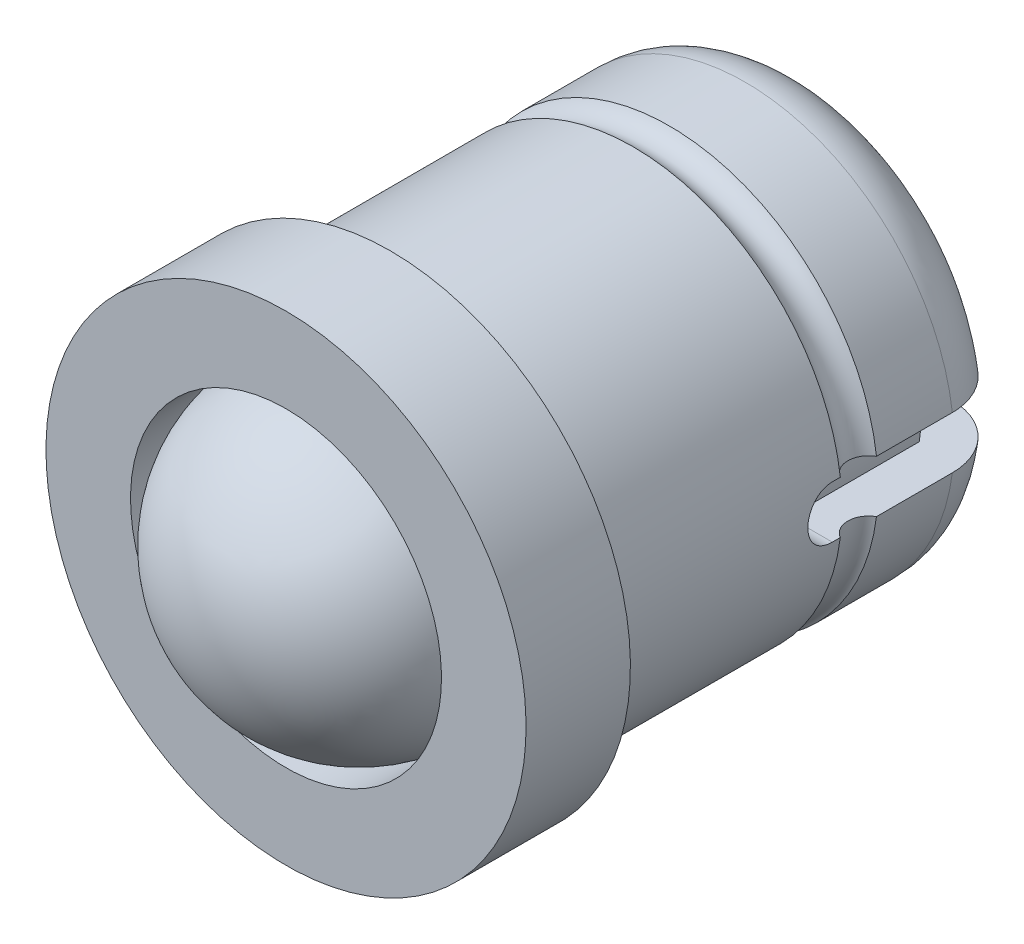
ISO-10303-21;
HEADER;
FILE_DESCRIPTION(('STEP AP214'),'2;1');
FILE_NAME('part.step','',(''),(''),'','','');
FILE_SCHEMA(('AUTOMOTIVE_DESIGN { 1 0 10303 214 1 1 1 1 }'));
ENDSEC;
DATA;
#1=APPLICATION_CONTEXT('core data for automotive mechanical design processes');
#2=APPLICATION_PROTOCOL_DEFINITION('international standard','automotive_design',2000,#1);
#3=PRODUCT_CONTEXT('',#1,'mechanical');
#4=PRODUCT('Part','Part','',(#3));
#5=PRODUCT_RELATED_PRODUCT_CATEGORY('part','',(#4));
#6=PRODUCT_DEFINITION_FORMATION('','',#4);
#7=PRODUCT_DEFINITION_CONTEXT('part definition',#1,'design');
#8=PRODUCT_DEFINITION('design','',#6,#7);
#9=PRODUCT_DEFINITION_SHAPE('','',#8);
#10=(LENGTH_UNIT() NAMED_UNIT(*) SI_UNIT(.MILLI.,.METRE.));
#11=(NAMED_UNIT(*) PLANE_ANGLE_UNIT() SI_UNIT($,.RADIAN.));
#12=(NAMED_UNIT(*) SI_UNIT($,.STERADIAN.) SOLID_ANGLE_UNIT());
#13=UNCERTAINTY_MEASURE_WITH_UNIT(LENGTH_MEASURE(1.E-05),#10,'distance_accuracy_value','');
#14=(GEOMETRIC_REPRESENTATION_CONTEXT(3) GLOBAL_UNCERTAINTY_ASSIGNED_CONTEXT((#13)) GLOBAL_UNIT_ASSIGNED_CONTEXT((#10,
#11,#12)) REPRESENTATION_CONTEXT('',''));
#15=CARTESIAN_POINT('',(0.,0.,0.));
#16=DIRECTION('',(0.,0.,1.));
#17=DIRECTION('',(1.,0.,0.));
#18=AXIS2_PLACEMENT_3D('',#15,#16,#17);
#19=CARTESIAN_POINT('',(2.3,-0.25,-2.25));
#20=DIRECTION('',(0.,1.,0.));
#21=DIRECTION('',(0.,0.,1.));
#22=AXIS2_PLACEMENT_3D('',#19,#20,#21);
#23=PLANE('',#22);
#24=DIRECTION('',(1.,0.,0.));
#25=VECTOR('',#24,1.);
#26=CARTESIAN_POINT('',(2.3,-0.25,-3.5));
#27=LINE('',#26,#25);
#28=CARTESIAN_POINT('',(-1.56793880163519,-0.25,-3.5));
#29=VERTEX_POINT('',#28);
#30=CARTESIAN_POINT('',(1.56793880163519,-0.25,-3.5));
#31=VERTEX_POINT('',#30);
#32=EDGE_CURVE('E322',#29,#31,#27,.T.);
#33=ORIENTED_EDGE('',*,*,#32,.T.);
#34=DIRECTION('',(0.,0.,-1.));
#35=VECTOR('',#34,1.);
#36=CARTESIAN_POINT('',(1.56793880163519,-0.25,-5.01992469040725));
#37=LINE('',#36,#35);
#38=CARTESIAN_POINT('',(1.5679388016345,-0.250000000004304,-2.24999999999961));
#39=VERTEX_POINT('',#38);
#40=EDGE_CURVE('E375',#39,#31,#37,.T.);
#41=ORIENTED_EDGE('',*,*,#40,.F.);
#42=DIRECTION('',(1.,0.,0.));
#43=VECTOR('',#42,1.);
#44=CARTESIAN_POINT('',(2.3,-0.25,-2.25));
#45=LINE('',#44,#43);
#46=CARTESIAN_POINT('',(1.98431348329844,-0.25,-2.25));
#47=VERTEX_POINT('',#46);
#48=EDGE_CURVE('E321',#39,#47,#45,.T.);
#49=ORIENTED_EDGE('',*,*,#48,.T.);
#50=DIRECTION('',(0.,0.,1.));
#51=VECTOR('',#50,1.);
#52=CARTESIAN_POINT('',(1.98431348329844,-0.25,-2.25));
#53=LINE('',#52,#51);
#54=CARTESIAN_POINT('',(1.98431348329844,-0.25,-2.32679491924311));
#55=VERTEX_POINT('',#54);
#56=EDGE_CURVE('E319',#47,#55,#53,.F.);
#57=ORIENTED_EDGE('',*,*,#56,.T.);
#58=CARTESIAN_POINT('',(1.98431348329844,-0.25,-2.32679491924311));
#59=CARTESIAN_POINT('',(1.97450228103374,-0.249999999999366,-2.33240525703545));
#60=CARTESIAN_POINT('',(1.96517261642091,-0.249999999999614,-2.33885164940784));
#61=CARTESIAN_POINT('',(1.94772239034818,-0.250000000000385,-2.35320730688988));
#62=CARTESIAN_POINT('',(1.93960134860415,-0.250000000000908,-2.36111598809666));
#63=CARTESIAN_POINT('',(1.92480132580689,-0.250000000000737,-2.37819740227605));
#64=CARTESIAN_POINT('',(1.91812329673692,-0.250000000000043,-2.38737096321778));
#65=CARTESIAN_POINT('',(1.90641397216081,-0.249999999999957,-2.40669802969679));
#66=CARTESIAN_POINT('',(1.90138216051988,-0.250000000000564,-2.41685122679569));
#67=CARTESIAN_POINT('',(1.88905855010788,-0.250000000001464,-2.44824910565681));
#68=CARTESIAN_POINT('',(1.88439436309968,-0.250000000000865,-2.47060089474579));
#69=CARTESIAN_POINT('',(1.88281472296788,-0.250000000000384,-2.51539323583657));
#70=CARTESIAN_POINT('',(1.88585114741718,-0.250000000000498,-2.53783236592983));
#71=CARTESIAN_POINT('',(1.89914808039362,-0.250000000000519,-2.58042773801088));
#72=CARTESIAN_POINT('',(1.90940254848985,-0.250000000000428,-2.60058587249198));
#73=CARTESIAN_POINT('',(1.93608040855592,-0.25000000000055,-2.63652359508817));
#74=CARTESIAN_POINT('',(1.95253448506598,-0.250000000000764,-2.65228071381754));
#75=CARTESIAN_POINT('',(1.97533189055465,-0.250000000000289,-2.66782991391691));
#76=CARTESIAN_POINT('',(1.97977424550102,-0.250000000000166,-2.67061035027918));
#77=CARTESIAN_POINT('',(1.98431348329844,-0.25,-2.67320508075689));
#78=B_SPLINE_CURVE_WITH_KNOTS('',3,(#58,#59,#60,#61,#62,#63,#64,#65,#66,#67,#68,#69,#70,#71,#72,
#73,#74,#75,#76,#77),.UNSPECIFIED.,.F.,.F.,(4,2,2,2,2,2,2,2,2,4),(0.,0.0338619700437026,
0.0677104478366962,0.101581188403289,0.135441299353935,0.202528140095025,0.269196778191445,
0.335809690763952,0.402756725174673,0.41846103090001),.UNSPECIFIED.);
#79=CARTESIAN_POINT('',(1.98431348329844,-0.25,-2.67320508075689));
#80=VERTEX_POINT('',#79);
#81=EDGE_CURVE('E125',#55,#80,#78,.T.);
#82=ORIENTED_EDGE('',*,*,#81,.T.);
#83=DIRECTION('',(0.,0.,1.));
#84=VECTOR('',#83,1.);
#85=CARTESIAN_POINT('',(1.98431348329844,-0.25,-2.25));
#86=LINE('',#85,#84);
#87=CARTESIAN_POINT('',(1.98431348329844,-0.25,-3.4));
#88=VERTEX_POINT('',#87);
#89=EDGE_CURVE('E316',#80,#88,#86,.F.);
#90=ORIENTED_EDGE('',*,*,#89,.T.);
#91=CARTESIAN_POINT('',(1.98431348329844,-0.25,-3.4));
#92=CARTESIAN_POINT('',(1.9843429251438,-0.25,-3.43354483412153));
#93=CARTESIAN_POINT('',(1.98147991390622,-0.25,-3.46707998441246));
#94=CARTESIAN_POINT('',(1.97018753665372,-0.25,-3.53316773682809));
#95=CARTESIAN_POINT('',(1.96176355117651,-0.25,-3.56572125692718));
#96=CARTESIAN_POINT('',(1.93956229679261,-0.25,-3.62896439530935));
#97=CARTESIAN_POINT('',(1.92578275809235,-0.25,-3.65965321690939));
#98=CARTESIAN_POINT('',(1.89328430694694,-0.25,-3.71828656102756));
#99=CARTESIAN_POINT('',(1.87456601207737,-0.25,-3.74623142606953));
#100=CARTESIAN_POINT('',(1.83267083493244,-0.25,-3.79867812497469));
#101=CARTESIAN_POINT('',(1.80948168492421,-0.25,-3.82317015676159));
#102=CARTESIAN_POINT('',(1.75934644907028,-0.25,-3.86794877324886));
#103=CARTESIAN_POINT('',(1.73240014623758,-0.25,-3.88823511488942));
#104=CARTESIAN_POINT('',(1.67530271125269,-0.25,-3.924197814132));
#105=CARTESIAN_POINT('',(1.64512855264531,-0.25,-3.93983756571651));
#106=CARTESIAN_POINT('',(1.58260588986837,-0.25,-3.96588752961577));
#107=CARTESIAN_POINT('',(1.55025815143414,-0.25,-3.97629957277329));
#108=CARTESIAN_POINT('',(1.4943789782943,-0.25,-3.98930708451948));
#109=CARTESIAN_POINT('',(1.47116620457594,-0.25,-3.99331782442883));
#110=CARTESIAN_POINT('',(1.42447061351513,-0.25,-3.99866415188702));
#111=CARTESIAN_POINT('',(1.40098826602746,-0.25,-4.00000384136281));
#112=CARTESIAN_POINT('',(1.3774977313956,-0.25,-4.));
#113=B_SPLINE_CURVE_WITH_KNOTS('',3,(#91,#92,#93,#94,#95,#96,#97,#98,#99,#100,#101,#102,#103,
#104,#105,#106,#107,#108,#109,#110,#111,#112),.UNSPECIFIED.,.F.,.F.,(4,2,2,2,2,2,2,2,2,2,4),(0.,
0.100498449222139,0.200899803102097,0.301343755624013,0.40177515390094,0.502486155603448,
0.603202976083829,0.70469340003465,0.806148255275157,0.87667346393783,0.947090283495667),.UNSPECIFIED.);
#114=CARTESIAN_POINT('',(1.3774977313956,-0.25,-4.));
#115=VERTEX_POINT('',#114);
#116=EDGE_CURVE('E318',#88,#115,#113,.T.);
#117=ORIENTED_EDGE('',*,*,#116,.T.);
#118=DIRECTION('',(1.,0.,0.));
#119=VECTOR('',#118,1.);
#120=CARTESIAN_POINT('',(0.,-0.25,-4.));
#121=LINE('',#120,#119);
#122=CARTESIAN_POINT('',(-1.37749773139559,-0.25,-4.));
#123=VERTEX_POINT('',#122);
#124=EDGE_CURVE('E270',#115,#123,#121,.F.);
#125=ORIENTED_EDGE('',*,*,#124,.T.);
#126=CARTESIAN_POINT('',(-1.37749773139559,-0.25,-4.));
#127=CARTESIAN_POINT('',(-1.41197125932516,-0.25,-4.00002968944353));
#128=CARTESIAN_POINT('',(-1.44644404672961,-0.25,-3.99712515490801));
#129=CARTESIAN_POINT('',(-1.51441638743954,-0.25,-3.98561734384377));
#130=CARTESIAN_POINT('',(-1.54791617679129,-0.25,-3.97701546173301));
#131=CARTESIAN_POINT('',(-1.61301562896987,-0.25,-3.95427306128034));
#132=CARTESIAN_POINT('',(-1.64461368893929,-0.25,-3.94012794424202));
#133=CARTESIAN_POINT('',(-1.7049416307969,-0.25,-3.90668652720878));
#134=CARTESIAN_POINT('',(-1.73367257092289,-0.25,-3.88739213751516));
#135=CARTESIAN_POINT('',(-1.78715532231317,-0.25,-3.84439738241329));
#136=CARTESIAN_POINT('',(-1.8119436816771,-0.25,-3.8207424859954));
#137=CARTESIAN_POINT('',(-1.85714450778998,-0.25,-3.76956834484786));
#138=CARTESIAN_POINT('',(-1.87755741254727,-0.25,-3.74204948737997));
#139=CARTESIAN_POINT('',(-1.91321635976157,-0.25,-3.68423325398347));
#140=CARTESIAN_POINT('',(-1.92851234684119,-0.25,-3.65396663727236));
#141=CARTESIAN_POINT('',(-1.95375877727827,-0.25,-3.59129114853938));
#142=CARTESIAN_POINT('',(-1.96371305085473,-0.249999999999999,-3.55888383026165));
#143=CARTESIAN_POINT('',(-1.97532648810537,-0.250000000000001,-3.50520766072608));
#144=CARTESIAN_POINT('',(-1.97869481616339,-0.250000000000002,-3.48429320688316));
#145=CARTESIAN_POINT('',(-1.98318775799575,-0.249999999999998,-3.44225559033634));
#146=CARTESIAN_POINT('',(-1.98431563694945,-0.249999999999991,-3.4211327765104));
#147=CARTESIAN_POINT('',(-1.98431348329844,-0.249999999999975,-3.4));
#148=B_SPLINE_CURVE_WITH_KNOTS('',3,(#126,#127,#128,#129,#130,#131,#132,#133,#134,#135,#136,
#137,#138,#139,#140,#141,#142,#143,#144,#145,#146,#147),.UNSPECIFIED.,.F.,.F.,(4,2,2,2,2,2,2,2,
2,2,4),(0.,0.103297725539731,0.206570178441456,0.309928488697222,0.413248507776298,
0.5155465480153,0.617834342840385,0.719092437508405,0.820277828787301,0.8837191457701,
0.947067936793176),.UNSPECIFIED.);
#149=CARTESIAN_POINT('',(-1.98431348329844,-0.25,-3.4));
#150=VERTEX_POINT('',#149);
#151=EDGE_CURVE('E315',#123,#150,#148,.T.);
#152=ORIENTED_EDGE('',*,*,#151,.T.);
#153=DIRECTION('',(0.,0.,1.));
#154=VECTOR('',#153,1.);
#155=CARTESIAN_POINT('',(-1.98431348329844,-0.25,-2.25));
#156=LINE('',#155,#154);
#157=CARTESIAN_POINT('',(-1.98431348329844,-0.25,-2.67320508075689));
#158=VERTEX_POINT('',#157);
#159=EDGE_CURVE('E131',#150,#158,#156,.T.);
#160=ORIENTED_EDGE('',*,*,#159,.T.);
#161=CARTESIAN_POINT('',(-1.98431348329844,-0.25,-2.67320508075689));
#162=CARTESIAN_POINT('',(-1.97450228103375,-0.249999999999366,-2.66759474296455));
#163=CARTESIAN_POINT('',(-1.96517261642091,-0.249999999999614,-2.66114835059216));
#164=CARTESIAN_POINT('',(-1.94772239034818,-0.250000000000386,-2.64679269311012));
#165=CARTESIAN_POINT('',(-1.93960134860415,-0.250000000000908,-2.63888401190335));
#166=CARTESIAN_POINT('',(-1.92480132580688,-0.250000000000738,-2.62180259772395));
#167=CARTESIAN_POINT('',(-1.91812329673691,-0.250000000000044,-2.61262903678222));
#168=CARTESIAN_POINT('',(-1.90641397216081,-0.249999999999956,-2.5933019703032));
#169=CARTESIAN_POINT('',(-1.90138216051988,-0.250000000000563,-2.58314877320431));
#170=CARTESIAN_POINT('',(-1.88905855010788,-0.250000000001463,-2.55175089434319));
#171=CARTESIAN_POINT('',(-1.88439436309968,-0.250000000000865,-2.52939910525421));
#172=CARTESIAN_POINT('',(-1.88281472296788,-0.250000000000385,-2.48460676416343));
#173=CARTESIAN_POINT('',(-1.88585114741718,-0.250000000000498,-2.46216763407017));
#174=CARTESIAN_POINT('',(-1.89914808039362,-0.25000000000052,-2.41957226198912));
#175=CARTESIAN_POINT('',(-1.90940254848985,-0.250000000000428,-2.39941412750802));
#176=CARTESIAN_POINT('',(-1.93608040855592,-0.250000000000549,-2.36347640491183));
#177=CARTESIAN_POINT('',(-1.95253448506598,-0.250000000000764,-2.34771928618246));
#178=CARTESIAN_POINT('',(-1.97533189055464,-0.250000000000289,-2.33217008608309));
#179=CARTESIAN_POINT('',(-1.97977424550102,-0.250000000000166,-2.32938964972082));
#180=CARTESIAN_POINT('',(-1.98431348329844,-0.25,-2.32679491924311));
#181=B_SPLINE_CURVE_WITH_KNOTS('',3,(#161,#162,#163,#164,#165,#166,#167,#168,#169,#170,#171,
#172,#173,#174,#175,#176,#177,#178,#179,#180),.UNSPECIFIED.,.F.,.F.,(4,2,2,2,2,2,2,2,2,4),(0.,
0.0338619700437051,0.0677104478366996,0.101581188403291,0.135441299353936,0.202528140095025,
0.269196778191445,0.335809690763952,0.402756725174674,0.418461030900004),.UNSPECIFIED.);
#182=CARTESIAN_POINT('',(-1.98431348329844,-0.25,-2.32679491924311));
#183=VERTEX_POINT('',#182);
#184=EDGE_CURVE('E118',#158,#183,#181,.T.);
#185=ORIENTED_EDGE('',*,*,#184,.T.);
#186=DIRECTION('',(0.,0.,1.));
#187=VECTOR('',#186,1.);
#188=CARTESIAN_POINT('',(-1.98431348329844,-0.25,-2.25));
#189=LINE('',#188,#187);
#190=CARTESIAN_POINT('',(-1.98431348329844,-0.25,-2.25));
#191=VERTEX_POINT('',#190);
#192=EDGE_CURVE('E104',#183,#191,#189,.T.);
#193=ORIENTED_EDGE('',*,*,#192,.T.);
#194=DIRECTION('',(1.,0.,0.));
#195=VECTOR('',#194,1.);
#196=CARTESIAN_POINT('',(2.3,-0.25,-2.25));
#197=LINE('',#196,#195);
#198=CARTESIAN_POINT('',(-1.56793880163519,-0.25,-2.25));
#199=VERTEX_POINT('',#198);
#200=EDGE_CURVE('E117',#191,#199,#197,.T.);
#201=ORIENTED_EDGE('',*,*,#200,.T.);
#202=DIRECTION('',(0.,0.,-1.));
#203=VECTOR('',#202,1.);
#204=CARTESIAN_POINT('',(-1.56793880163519,-0.25,-5.01992469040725));
#205=LINE('',#204,#203);
#206=EDGE_CURVE('E240',#29,#199,#205,.F.);
#207=ORIENTED_EDGE('',*,*,#206,.F.);
#208=EDGE_LOOP('',(#33,#41,#49,#57,#82,#90,#117,#125,#152,#160,#185,#193,#201,#207));
#209=FACE_BOUND('',#208,.T.);
#210=ADVANCED_FACE('F14',(#209),#23,.T.);
#211=CARTESIAN_POINT('',(2.3,0.25,-4.));
#212=DIRECTION('',(0.,-1.,0.));
#213=DIRECTION('',(0.,0.,-1.));
#214=AXIS2_PLACEMENT_3D('',#211,#212,#213);
#215=PLANE('',#214);
#216=DIRECTION('',(1.,0.,0.));
#217=VECTOR('',#216,1.);
#218=CARTESIAN_POINT('',(2.3,0.25,-3.5));
#219=LINE('',#218,#217);
#220=CARTESIAN_POINT('',(1.56793880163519,0.25,-3.5));
#221=VERTEX_POINT('',#220);
#222=CARTESIAN_POINT('',(-1.56793880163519,0.25,-3.5));
#223=VERTEX_POINT('',#222);
#224=EDGE_CURVE('E306',#221,#223,#219,.F.);
#225=ORIENTED_EDGE('',*,*,#224,.T.);
#226=DIRECTION('',(0.,0.,-1.));
#227=VECTOR('',#226,1.);
#228=CARTESIAN_POINT('',(-1.56793880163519,0.25,-5.01992469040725));
#229=LINE('',#228,#227);
#230=CARTESIAN_POINT('',(-1.56793880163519,0.25,-2.25));
#231=VERTEX_POINT('',#230);
#232=EDGE_CURVE('E343',#231,#223,#229,.T.);
#233=ORIENTED_EDGE('',*,*,#232,.F.);
#234=DIRECTION('',(1.,0.,0.));
#235=VECTOR('',#234,1.);
#236=CARTESIAN_POINT('',(2.3,0.25,-2.25));
#237=LINE('',#236,#235);
#238=CARTESIAN_POINT('',(-1.98431348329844,0.25,-2.25));
#239=VERTEX_POINT('',#238);
#240=EDGE_CURVE('E305',#231,#239,#237,.F.);
#241=ORIENTED_EDGE('',*,*,#240,.T.);
#242=DIRECTION('',(0.,0.,-1.));
#243=VECTOR('',#242,1.);
#244=CARTESIAN_POINT('',(-1.98431348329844,0.25,-4.));
#245=LINE('',#244,#243);
#246=CARTESIAN_POINT('',(-1.98431348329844,0.25,-2.32679491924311));
#247=VERTEX_POINT('',#246);
#248=EDGE_CURVE('E222',#239,#247,#245,.T.);
#249=ORIENTED_EDGE('',*,*,#248,.T.);
#250=CARTESIAN_POINT('',(-1.98431348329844,0.25,-2.32679491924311));
#251=CARTESIAN_POINT('',(-1.97450228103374,0.249999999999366,-2.33240525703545));
#252=CARTESIAN_POINT('',(-1.96517261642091,0.249999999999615,-2.33885164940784));
#253=CARTESIAN_POINT('',(-1.94772239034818,0.250000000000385,-2.35320730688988));
#254=CARTESIAN_POINT('',(-1.93960134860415,0.250000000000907,-2.36111598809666));
#255=CARTESIAN_POINT('',(-1.92480132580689,0.250000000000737,-2.37819740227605));
#256=CARTESIAN_POINT('',(-1.91812329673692,0.250000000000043,-2.38737096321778));
#257=CARTESIAN_POINT('',(-1.90641397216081,0.249999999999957,-2.40669802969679));
#258=CARTESIAN_POINT('',(-1.90138216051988,0.250000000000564,-2.41685122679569));
#259=CARTESIAN_POINT('',(-1.88905855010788,0.250000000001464,-2.44824910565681));
#260=CARTESIAN_POINT('',(-1.88439436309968,0.250000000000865,-2.47060089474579));
#261=CARTESIAN_POINT('',(-1.88281472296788,0.250000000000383,-2.51539323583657));
#262=CARTESIAN_POINT('',(-1.88585114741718,0.250000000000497,-2.53783236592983));
#263=CARTESIAN_POINT('',(-1.89914808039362,0.250000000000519,-2.58042773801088));
#264=CARTESIAN_POINT('',(-1.90940254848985,0.250000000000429,-2.60058587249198));
#265=CARTESIAN_POINT('',(-1.93608040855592,0.25000000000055,-2.63652359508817));
#266=CARTESIAN_POINT('',(-1.95253448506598,0.250000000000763,-2.65228071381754));
#267=CARTESIAN_POINT('',(-1.97533189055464,0.250000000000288,-2.66782991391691));
#268=CARTESIAN_POINT('',(-1.97977424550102,0.250000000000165,-2.67061035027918));
#269=CARTESIAN_POINT('',(-1.98431348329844,0.25,-2.67320508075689));
#270=B_SPLINE_CURVE_WITH_KNOTS('',3,(#250,#251,#252,#253,#254,#255,#256,#257,#258,#259,#260,
#261,#262,#263,#264,#265,#266,#267,#268,#269),.UNSPECIFIED.,.F.,.F.,(4,2,2,2,2,2,2,2,2,4),(0.,
0.0338619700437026,0.0677104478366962,0.101581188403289,0.135441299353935,0.202528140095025,
0.269196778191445,0.335809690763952,0.402756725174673,0.418461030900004),.UNSPECIFIED.);
#271=CARTESIAN_POINT('',(-1.98431348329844,0.25,-2.67320508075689));
#272=VERTEX_POINT('',#271);
#273=EDGE_CURVE('E215',#247,#272,#270,.T.);
#274=ORIENTED_EDGE('',*,*,#273,.T.);
#275=DIRECTION('',(0.,0.,-1.));
#276=VECTOR('',#275,1.);
#277=CARTESIAN_POINT('',(-1.98431348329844,0.25,-4.));
#278=LINE('',#277,#276);
#279=CARTESIAN_POINT('',(-1.98431348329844,0.25,-3.4));
#280=VERTEX_POINT('',#279);
#281=EDGE_CURVE('E221',#272,#280,#278,.T.);
#282=ORIENTED_EDGE('',*,*,#281,.T.);
#283=CARTESIAN_POINT('',(-1.98431348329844,0.25,-3.4));
#284=CARTESIAN_POINT('',(-1.9843429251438,0.25,-3.43354483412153));
#285=CARTESIAN_POINT('',(-1.98147991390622,0.25,-3.46707998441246));
#286=CARTESIAN_POINT('',(-1.97018753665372,0.25,-3.53316773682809));
#287=CARTESIAN_POINT('',(-1.96176355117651,0.25,-3.56572125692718));
#288=CARTESIAN_POINT('',(-1.93956229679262,0.25,-3.62896439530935));
#289=CARTESIAN_POINT('',(-1.92578275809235,0.25,-3.65965321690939));
#290=CARTESIAN_POINT('',(-1.89328430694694,0.25,-3.71828656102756));
#291=CARTESIAN_POINT('',(-1.87456601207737,0.25,-3.74623142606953));
#292=CARTESIAN_POINT('',(-1.83267083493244,0.25,-3.79867812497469));
#293=CARTESIAN_POINT('',(-1.80948168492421,0.25,-3.82317015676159));
#294=CARTESIAN_POINT('',(-1.75934644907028,0.25,-3.86794877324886));
#295=CARTESIAN_POINT('',(-1.73240014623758,0.25,-3.88823511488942));
#296=CARTESIAN_POINT('',(-1.67530271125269,0.25,-3.924197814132));
#297=CARTESIAN_POINT('',(-1.64512855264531,0.25,-3.93983756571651));
#298=CARTESIAN_POINT('',(-1.58260588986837,0.25,-3.96588752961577));
#299=CARTESIAN_POINT('',(-1.55025815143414,0.25,-3.97629957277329));
#300=CARTESIAN_POINT('',(-1.49437897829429,0.25,-3.98930708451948));
#301=CARTESIAN_POINT('',(-1.47116620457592,0.25,-3.99331782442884));
#302=CARTESIAN_POINT('',(-1.42447061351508,0.25,-3.99866415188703));
#303=CARTESIAN_POINT('',(-1.4009882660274,0.25,-4.00000384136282));
#304=CARTESIAN_POINT('',(-1.37749773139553,0.25,-4.));
#305=B_SPLINE_CURVE_WITH_KNOTS('',3,(#283,#284,#285,#286,#287,#288,#289,#290,#291,#292,#293,
#294,#295,#296,#297,#298,#299,#300,#301,#302,#303,#304),.UNSPECIFIED.,.F.,.F.,(4,2,2,2,2,2,2,2,
2,2,4),(0.,0.100498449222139,0.200899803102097,0.301343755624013,0.40177515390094,
0.502486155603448,0.603202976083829,0.70469340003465,0.806148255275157,0.876673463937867,
0.94709028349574),.UNSPECIFIED.);
#306=CARTESIAN_POINT('',(-1.37749773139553,0.249999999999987,-4.));
#307=VERTEX_POINT('',#306);
#308=EDGE_CURVE('E42',#280,#307,#305,.T.);
#309=ORIENTED_EDGE('',*,*,#308,.T.);
#310=DIRECTION('',(1.,0.,0.));
#311=VECTOR('',#310,1.);
#312=CARTESIAN_POINT('',(0.,0.25,-4.));
#313=LINE('',#312,#311);
#314=CARTESIAN_POINT('',(1.37749773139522,0.25,-4.));
#315=VERTEX_POINT('',#314);
#316=EDGE_CURVE('E266',#307,#315,#313,.T.);
#317=ORIENTED_EDGE('',*,*,#316,.T.);
#318=CARTESIAN_POINT('',(1.37749773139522,0.25,-4.));
#319=CARTESIAN_POINT('',(1.41197125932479,0.25,-4.00002968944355));
#320=CARTESIAN_POINT('',(1.44644404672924,0.25,-3.99712515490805));
#321=CARTESIAN_POINT('',(1.51441638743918,0.25,-3.98561734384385));
#322=CARTESIAN_POINT('',(1.54791617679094,0.25,-3.97701546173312));
#323=CARTESIAN_POINT('',(1.61301562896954,0.25,-3.95427306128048));
#324=CARTESIAN_POINT('',(1.64461368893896,0.25,-3.94012794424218));
#325=CARTESIAN_POINT('',(1.70494163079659,0.25,-3.90668652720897));
#326=CARTESIAN_POINT('',(1.7336725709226,0.25,-3.88739213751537));
#327=CARTESIAN_POINT('',(1.7871553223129,0.25,-3.84439738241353));
#328=CARTESIAN_POINT('',(1.81194368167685,0.25,-3.82074248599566));
#329=CARTESIAN_POINT('',(1.85714450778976,0.25,-3.76956834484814));
#330=CARTESIAN_POINT('',(1.87755741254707,0.25,-3.74204948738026));
#331=CARTESIAN_POINT('',(1.9132163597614,0.25,-3.68423325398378));
#332=CARTESIAN_POINT('',(1.92851234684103,0.25,-3.65396663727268));
#333=CARTESIAN_POINT('',(1.95375877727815,0.25,-3.59129114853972));
#334=CARTESIAN_POINT('',(1.96371305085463,0.249999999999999,-3.55888383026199));
#335=CARTESIAN_POINT('',(1.97532648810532,0.250000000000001,-3.50520766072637));
#336=CARTESIAN_POINT('',(1.97869481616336,0.250000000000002,-3.48429320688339));
#337=CARTESIAN_POINT('',(1.98318775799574,0.249999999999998,-3.44225559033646));
#338=CARTESIAN_POINT('',(1.98431563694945,0.249999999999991,-3.42113277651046));
#339=CARTESIAN_POINT('',(1.98431348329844,0.249999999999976,-3.4));
#340=B_SPLINE_CURVE_WITH_KNOTS('',3,(#318,#319,#320,#321,#322,#323,#324,#325,#326,#327,#328,
#329,#330,#331,#332,#333,#334,#335,#336,#337,#338,#339),.UNSPECIFIED.,.F.,.F.,(4,2,2,2,2,2,2,2,
2,2,4),(0.,0.103297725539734,0.206570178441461,0.30992848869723,0.413248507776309,
0.515546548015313,0.617834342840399,0.719092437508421,0.820277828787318,0.883719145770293,
0.947067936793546),.UNSPECIFIED.);
#341=CARTESIAN_POINT('',(1.98431348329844,0.25,-3.4));
#342=VERTEX_POINT('',#341);
#343=EDGE_CURVE('E197',#315,#342,#340,.T.);
#344=ORIENTED_EDGE('',*,*,#343,.T.);
#345=DIRECTION('',(0.,0.,-1.));
#346=VECTOR('',#345,1.);
#347=CARTESIAN_POINT('',(1.98431348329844,0.25,-4.));
#348=LINE('',#347,#346);
#349=CARTESIAN_POINT('',(1.98431348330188,0.25,-2.67320508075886));
#350=VERTEX_POINT('',#349);
#351=EDGE_CURVE('E295',#342,#350,#348,.F.);
#352=ORIENTED_EDGE('',*,*,#351,.T.);
#353=CARTESIAN_POINT('',(1.98431348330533,0.25,-2.67320508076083));
#354=CARTESIAN_POINT('',(1.9745022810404,0.249999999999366,-2.66759474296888));
#355=CARTESIAN_POINT('',(1.96517261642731,0.249999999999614,-2.66114835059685));
#356=CARTESIAN_POINT('',(1.947722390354,0.250000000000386,-2.64679269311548));
#357=CARTESIAN_POINT('',(1.93960134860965,0.250000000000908,-2.63888401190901));
#358=CARTESIAN_POINT('',(1.9248013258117,0.250000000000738,-2.62180259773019));
#359=CARTESIAN_POINT('',(1.91812329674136,0.250000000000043,-2.61262903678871));
#360=CARTESIAN_POINT('',(1.90641397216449,0.249999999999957,-2.59330197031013));
#361=CARTESIAN_POINT('',(1.90138216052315,0.250000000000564,-2.58314877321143));
#362=CARTESIAN_POINT('',(1.88905855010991,0.250000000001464,-2.55175089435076));
#363=CARTESIAN_POINT('',(1.88439436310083,0.250000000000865,-2.52939910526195));
#364=CARTESIAN_POINT('',(1.88281472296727,0.250000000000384,-2.48460676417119));
#365=CARTESIAN_POINT('',(1.88585114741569,0.250000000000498,-2.4621676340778));
#366=CARTESIAN_POINT('',(1.89914808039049,0.250000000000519,-2.41957226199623));
#367=CARTESIAN_POINT('',(1.90940254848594,0.250000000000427,-2.39941412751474));
#368=CARTESIAN_POINT('',(1.93608040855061,0.250000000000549,-2.36347640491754));
#369=CARTESIAN_POINT('',(1.95253448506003,0.250000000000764,-2.34771928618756));
#370=CARTESIAN_POINT('',(1.97533189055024,0.250000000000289,-2.33217008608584));
#371=CARTESIAN_POINT('',(1.97977424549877,0.250000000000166,-2.3293896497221));
#372=CARTESIAN_POINT('',(1.98431348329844,0.25,-2.32679491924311));
#373=B_SPLINE_CURVE_WITH_KNOTS('',3,(#353,#354,#355,#356,#357,#358,#359,#360,#361,#362,#363,
#364,#365,#366,#367,#368,#369,#370,#371,#372),.UNSPECIFIED.,.F.,.F.,(4,2,2,2,2,2,2,2,2,4),(0.,
0.0338619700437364,0.0677104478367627,0.101581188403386,0.135441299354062,0.202528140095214,
0.269196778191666,0.335809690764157,0.402756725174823,0.418461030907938),.UNSPECIFIED.);
#374=CARTESIAN_POINT('',(1.98431348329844,0.25,-2.32679491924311));
#375=VERTEX_POINT('',#374);
#376=EDGE_CURVE('E223',#350,#375,#373,.T.);
#377=ORIENTED_EDGE('',*,*,#376,.T.);
#378=DIRECTION('',(0.,0.,-1.));
#379=VECTOR('',#378,1.);
#380=CARTESIAN_POINT('',(1.98431348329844,0.25,-4.));
#381=LINE('',#380,#379);
#382=CARTESIAN_POINT('',(1.98431348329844,0.25,-2.25));
#383=VERTEX_POINT('',#382);
#384=EDGE_CURVE('E311',#375,#383,#381,.F.);
#385=ORIENTED_EDGE('',*,*,#384,.T.);
#386=DIRECTION('',(1.,0.,0.));
#387=VECTOR('',#386,1.);
#388=CARTESIAN_POINT('',(2.3,0.25,-2.25));
#389=LINE('',#388,#387);
#390=CARTESIAN_POINT('',(1.56793880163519,0.25,-2.25));
#391=VERTEX_POINT('',#390);
#392=EDGE_CURVE('E308',#383,#391,#389,.F.);
#393=ORIENTED_EDGE('',*,*,#392,.T.);
#394=DIRECTION('',(0.,0.,-1.));
#395=VECTOR('',#394,1.);
#396=CARTESIAN_POINT('',(1.56793880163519,0.25,-5.01992469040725));
#397=LINE('',#396,#395);
#398=EDGE_CURVE('E34',#221,#391,#397,.F.);
#399=ORIENTED_EDGE('',*,*,#398,.F.);
#400=EDGE_LOOP('',(#225,#233,#241,#249,#274,#282,#309,#317,#344,#352,#377,#385,#393,#399));
#401=FACE_BOUND('',#400,.T.);
#402=ADVANCED_FACE('F199',(#401),#215,.T.);
#403=CARTESIAN_POINT('',(0.,0.,1.));
#404=DIRECTION('',(0.,0.,-1.));
#405=DIRECTION('',(0.,1.,0.));
#406=AXIS2_PLACEMENT_3D('',#403,#404,#405);
#407=CYLINDRICAL_SURFACE('',#406,1.49);
#408=CARTESIAN_POINT('',(0.,0.,0.472916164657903));
#409=DIRECTION('',(0.,0.,-1.));
#410=DIRECTION('',(0.,1.,0.));
#411=AXIS2_PLACEMENT_3D('',#408,#409,#410);
#412=CIRCLE('',#411,1.49);
#413=CARTESIAN_POINT('',(0.,1.49,0.472916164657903));
#414=VERTEX_POINT('',#413);
#415=EDGE_CURVE('E133',#414,#414,#412,.T.);
#416=ORIENTED_EDGE('',*,*,#415,.T.);
#417=EDGE_LOOP('',(#416));
#418=FACE_BOUND('',#417,.T.);
#419=CARTESIAN_POINT('',(0.,0.,1.));
#420=DIRECTION('',(0.,0.,-1.));
#421=DIRECTION('',(0.,1.,0.));
#422=AXIS2_PLACEMENT_3D('',#419,#420,#421);
#423=CIRCLE('',#422,1.49);
#424=CARTESIAN_POINT('',(0.,1.49,1.));
#425=VERTEX_POINT('',#424);
#426=EDGE_CURVE('E263',#425,#425,#423,.F.);
#427=ORIENTED_EDGE('',*,*,#426,.T.);
#428=EDGE_LOOP('',(#427));
#429=FACE_BOUND('',#428,.T.);
#430=ADVANCED_FACE('F203',(#418,#429),#407,.F.);
#431=CARTESIAN_POINT('',(0.,0.,-4.));
#432=DIRECTION('',(0.,0.,1.));
#433=DIRECTION('',(0.,-1.,0.));
#434=AXIS2_PLACEMENT_3D('',#431,#432,#433);
#435=PLANE('',#434);
#436=CARTESIAN_POINT('',(0.,0.,-4.));
#437=DIRECTION('',(0.,0.,1.));
#438=DIRECTION('',(-0.983926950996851,-0.17857142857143,0.));
#439=AXIS2_PLACEMENT_3D('',#436,#437,#438);
#440=CIRCLE('',#439,1.4);
#441=EDGE_CURVE('E265',#123,#115,#440,.T.);
#442=ORIENTED_EDGE('',*,*,#441,.F.);
#443=ORIENTED_EDGE('',*,*,#124,.F.);
#444=EDGE_LOOP('',(#442,#443));
#445=FACE_BOUND('',#444,.T.);
#446=ADVANCED_FACE('F414',(#445),#435,.F.);
#447=CARTESIAN_POINT('',(0.,0.,-4.));
#448=DIRECTION('',(0.,0.,1.));
#449=DIRECTION('',(0.,-1.,0.));
#450=AXIS2_PLACEMENT_3D('',#447,#448,#449);
#451=PLANE('',#450);
#452=CARTESIAN_POINT('',(0.,0.,-4.));
#453=DIRECTION('',(0.,0.,1.));
#454=DIRECTION('',(0.983926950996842,0.178571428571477,0.));
#455=AXIS2_PLACEMENT_3D('',#452,#453,#454);
#456=CIRCLE('',#455,1.39999999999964);
#457=EDGE_CURVE('E262',#315,#307,#456,.T.);
#458=ORIENTED_EDGE('',*,*,#457,.F.);
#459=ORIENTED_EDGE('',*,*,#316,.F.);
#460=EDGE_LOOP('',(#458,#459));
#461=FACE_BOUND('',#460,.T.);
#462=ADVANCED_FACE('F287',(#461),#451,.F.);
#463=CARTESIAN_POINT('',(2.3,0.,1.));
#464=DIRECTION('',(0.,0.,-1.));
#465=DIRECTION('',(0.,1.,0.));
#466=AXIS2_PLACEMENT_3D('',#463,#464,#465);
#467=PLANE('',#466);
#468=CARTESIAN_POINT('',(0.,0.,1.));
#469=DIRECTION('',(0.,0.,-1.));
#470=DIRECTION('',(0.,1.,0.));
#471=AXIS2_PLACEMENT_3D('',#468,#469,#470);
#472=CIRCLE('',#471,2.3);
#473=CARTESIAN_POINT('',(0.,2.3,1.));
#474=VERTEX_POINT('',#473);
#475=EDGE_CURVE('E259',#474,#474,#472,.T.);
#476=ORIENTED_EDGE('',*,*,#475,.F.);
#477=EDGE_LOOP('',(#476));
#478=FACE_BOUND('',#477,.T.);
#479=ORIENTED_EDGE('',*,*,#426,.F.);
#480=EDGE_LOOP('',(#479));
#481=FACE_BOUND('',#480,.T.);
#482=ADVANCED_FACE('F429',(#478,#481),#467,.F.);
#483=CARTESIAN_POINT('',(0.,0.,-3.4));
#484=DIRECTION('',(0.,0.,1.));
#485=DIRECTION('',(0.,-1.,0.));
#486=AXIS2_PLACEMENT_3D('',#483,#484,#485);
#487=TOROIDAL_SURFACE('',#486,1.4,0.6);
#488=ORIENTED_EDGE('',*,*,#441,.T.);
#489=ORIENTED_EDGE('',*,*,#116,.F.);
#490=CARTESIAN_POINT('',(0.,0.,-3.4));
#491=DIRECTION('',(0.,0.,-1.));
#492=DIRECTION('',(0.,1.,0.));
#493=AXIS2_PLACEMENT_3D('',#490,#491,#492);
#494=CIRCLE('',#493,2.);
#495=EDGE_CURVE('E261',#150,#88,#494,.F.);
#496=ORIENTED_EDGE('',*,*,#495,.F.);
#497=ORIENTED_EDGE('',*,*,#151,.F.);
#498=EDGE_LOOP('',(#488,#489,#496,#497));
#499=FACE_BOUND('',#498,.T.);
#500=ADVANCED_FACE('F176',(#499),#487,.T.);
#501=CARTESIAN_POINT('',(0.,0.,-3.4));
#502=DIRECTION('',(0.,0.,1.));
#503=DIRECTION('',(0.,-1.,0.));
#504=AXIS2_PLACEMENT_3D('',#501,#502,#503);
#505=TOROIDAL_SURFACE('',#504,1.4,0.6);
#506=CARTESIAN_POINT('',(0.,0.,-3.4));
#507=DIRECTION('',(0.,0.,-1.));
#508=DIRECTION('',(0.,1.,0.));
#509=AXIS2_PLACEMENT_3D('',#506,#507,#508);
#510=CIRCLE('',#509,2.);
#511=EDGE_CURVE('E167',#342,#280,#510,.F.);
#512=ORIENTED_EDGE('',*,*,#511,.F.);
#513=ORIENTED_EDGE('',*,*,#343,.F.);
#514=ORIENTED_EDGE('',*,*,#457,.T.);
#515=ORIENTED_EDGE('',*,*,#308,.F.);
#516=EDGE_LOOP('',(#512,#513,#514,#515));
#517=FACE_BOUND('',#516,.T.);
#518=ADVANCED_FACE('F170',(#517),#505,.T.);
#519=CARTESIAN_POINT('',(0.,0.,1.));
#520=DIRECTION('',(0.,0.,-1.));
#521=DIRECTION('',(0.,1.,0.));
#522=AXIS2_PLACEMENT_3D('',#519,#520,#521);
#523=CYLINDRICAL_SURFACE('',#522,2.3);
#524=CARTESIAN_POINT('',(0.,0.,0.));
#525=DIRECTION('',(0.,0.,-1.));
#526=DIRECTION('',(0.,1.,0.));
#527=AXIS2_PLACEMENT_3D('',#524,#525,#526);
#528=CIRCLE('',#527,2.3);
#529=CARTESIAN_POINT('',(0.,2.3,0.));
#530=VERTEX_POINT('',#529);
#531=EDGE_CURVE('E163',#530,#530,#528,.F.);
#532=ORIENTED_EDGE('',*,*,#531,.T.);
#533=EDGE_LOOP('',(#532));
#534=FACE_BOUND('',#533,.T.);
#535=ORIENTED_EDGE('',*,*,#475,.T.);
#536=EDGE_LOOP('',(#535));
#537=FACE_BOUND('',#536,.T.);
#538=ADVANCED_FACE('F175',(#534,#537),#523,.T.);
#539=CARTESIAN_POINT('',(0.,0.,1.));
#540=DIRECTION('',(0.,0.,-1.));
#541=DIRECTION('',(0.,1.,0.));
#542=AXIS2_PLACEMENT_3D('',#539,#540,#541);
#543=CYLINDRICAL_SURFACE('',#542,2.);
#544=ORIENTED_EDGE('',*,*,#89,.F.);
#545=CARTESIAN_POINT('',(0.,0.,-2.67320508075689));
#546=DIRECTION('',(0.,0.,1.));
#547=DIRECTION('',(0.,-1.,0.));
#548=AXIS2_PLACEMENT_3D('',#545,#546,#547);
#549=CIRCLE('',#548,2.);
#550=EDGE_CURVE('E161',#80,#158,#549,.F.);
#551=ORIENTED_EDGE('',*,*,#550,.T.);
#552=ORIENTED_EDGE('',*,*,#159,.F.);
#553=ORIENTED_EDGE('',*,*,#495,.T.);
#554=EDGE_LOOP('',(#544,#551,#552,#553));
#555=FACE_BOUND('',#554,.T.);
#556=ADVANCED_FACE('F455',(#555),#543,.T.);
#557=CARTESIAN_POINT('',(0.,0.,1.));
#558=DIRECTION('',(0.,0.,-1.));
#559=DIRECTION('',(0.,1.,0.));
#560=AXIS2_PLACEMENT_3D('',#557,#558,#559);
#561=CYLINDRICAL_SURFACE('',#560,2.);
#562=ORIENTED_EDGE('',*,*,#281,.F.);
#563=CARTESIAN_POINT('',(0.,0.,-2.67320508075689));
#564=DIRECTION('',(0.,0.,1.));
#565=DIRECTION('',(0.,-1.,0.));
#566=AXIS2_PLACEMENT_3D('',#563,#564,#565);
#567=CIRCLE('',#566,2.);
#568=EDGE_CURVE('E162',#272,#350,#567,.F.);
#569=ORIENTED_EDGE('',*,*,#568,.T.);
#570=ORIENTED_EDGE('',*,*,#351,.F.);
#571=ORIENTED_EDGE('',*,*,#511,.T.);
#572=EDGE_LOOP('',(#562,#569,#570,#571));
#573=FACE_BOUND('',#572,.T.);
#574=ADVANCED_FACE('F294',(#573),#561,.T.);
#575=CARTESIAN_POINT('',(2.,0.,0.));
#576=DIRECTION('',(0.,0.,1.));
#577=DIRECTION('',(0.,-1.,0.));
#578=AXIS2_PLACEMENT_3D('',#575,#576,#577);
#579=PLANE('',#578);
#580=CARTESIAN_POINT('',(0.,0.,0.));
#581=DIRECTION('',(0.,0.,-1.));
#582=DIRECTION('',(0.,1.,0.));
#583=AXIS2_PLACEMENT_3D('',#580,#581,#582);
#584=CIRCLE('',#583,2.);
#585=CARTESIAN_POINT('',(0.,2.,0.));
#586=VERTEX_POINT('',#585);
#587=EDGE_CURVE('E243',#586,#586,#584,.T.);
#588=ORIENTED_EDGE('',*,*,#587,.F.);
#589=EDGE_LOOP('',(#588));
#590=FACE_BOUND('',#589,.T.);
#591=ORIENTED_EDGE('',*,*,#531,.F.);
#592=EDGE_LOOP('',(#591));
#593=FACE_BOUND('',#592,.T.);
#594=ADVANCED_FACE('F469',(#590,#593),#579,.F.);
#595=CARTESIAN_POINT('',(2.3,0.,-2.25));
#596=DIRECTION('',(1.,0.,0.));
#597=DIRECTION('',(0.,1.,0.));
#598=AXIS2_PLACEMENT_3D('',#595,#596,#597);
#599=CYLINDRICAL_SURFACE('',#598,0.25);
#600=ORIENTED_EDGE('',*,*,#240,.F.);
#601=CARTESIAN_POINT('',(-1.56793880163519,0.25,-2.25));
#602=CARTESIAN_POINT('',(-1.56793151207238,0.250012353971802,-2.23602790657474));
#603=CARTESIAN_POINT('',(-1.56812536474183,0.248829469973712,-2.22206136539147));
#604=CARTESIAN_POINT('',(-1.56886093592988,0.244166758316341,-2.1945436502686));
#605=CARTESIAN_POINT('',(-1.56940221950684,0.240689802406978,-2.18099197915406));
#606=CARTESIAN_POINT('',(-1.57077865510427,0.231530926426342,-2.15466817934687));
#607=CARTESIAN_POINT('',(-1.57161387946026,0.22584846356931,-2.14189624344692));
#608=CARTESIAN_POINT('',(-1.57348150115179,0.212447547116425,-2.11748661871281));
#609=CARTESIAN_POINT('',(-1.57451389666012,0.204729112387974,-2.10584891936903));
#610=CARTESIAN_POINT('',(-1.57667013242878,0.187402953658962,-2.08393751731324));
#611=CARTESIAN_POINT('',(-1.57779462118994,0.177781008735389,-2.07367512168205));
#612=CARTESIAN_POINT('',(-1.58000254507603,0.156950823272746,-2.05490247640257));
#613=CARTESIAN_POINT('',(-1.58108597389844,0.145742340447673,-2.04639249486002));
#614=CARTESIAN_POINT('',(-1.5830965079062,0.121984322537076,-2.03132508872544));
#615=CARTESIAN_POINT('',(-1.58402275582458,0.109428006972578,-2.02477823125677));
#616=CARTESIAN_POINT('',(-1.58560724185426,0.0833776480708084,-2.01389110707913));
#617=CARTESIAN_POINT('',(-1.58626551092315,0.0698837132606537,-2.00955058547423));
#618=CARTESIAN_POINT('',(-1.58723533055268,0.0424584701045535,-2.00323360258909));
#619=CARTESIAN_POINT('',(-1.58754969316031,0.0285316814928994,-2.00123795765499));
#620=CARTESIAN_POINT('',(-1.58780593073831,0.000537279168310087,-1.9996077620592));
#621=CARTESIAN_POINT('',(-1.58774781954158,-0.0135303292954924,-1.99997312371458));
#622=CARTESIAN_POINT('',(-1.58726788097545,-0.041275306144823,-2.00303959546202));
#623=CARTESIAN_POINT('',(-1.58684927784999,-0.0549550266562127,-2.0057200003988));
#624=CARTESIAN_POINT('',(-1.58569898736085,-0.0816679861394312,-2.01330790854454));
#625=CARTESIAN_POINT('',(-1.5849672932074,-0.0947012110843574,-2.01821546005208));
#626=CARTESIAN_POINT('',(-1.58326749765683,-0.119813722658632,-2.03013938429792));
#627=CARTESIAN_POINT('',(-1.58229842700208,-0.131888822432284,-2.03716443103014));
#628=CARTESIAN_POINT('',(-1.58023179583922,-0.154696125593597,-2.05311729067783));
#629=CARTESIAN_POINT('',(-1.57913423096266,-0.165428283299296,-2.06204516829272));
#630=CARTESIAN_POINT('',(-1.5769189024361,-0.185366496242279,-2.08166415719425));
#631=CARTESIAN_POINT('',(-1.5758010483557,-0.194554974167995,-2.09237313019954));
#632=CARTESIAN_POINT('',(-1.57368233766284,-0.211009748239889,-2.11519353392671));
#633=CARTESIAN_POINT('',(-1.57268151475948,-0.218275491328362,-2.12730536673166));
#634=CARTESIAN_POINT('',(-1.5709096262,-0.23068228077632,-2.15261074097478));
#635=CARTESIAN_POINT('',(-1.57013890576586,-0.235820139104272,-2.16580587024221));
#636=CARTESIAN_POINT('',(-1.56892155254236,-0.243791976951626,-2.19287102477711));
#637=CARTESIAN_POINT('',(-1.5684744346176,-0.246629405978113,-2.20674000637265));
#638=CARTESIAN_POINT('',(-1.56802954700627,-0.249428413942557,-2.23045475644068));
#639=CARTESIAN_POINT('',(-1.56793600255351,-0.250005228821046,-2.24022940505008));
#640=CARTESIAN_POINT('',(-1.56793880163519,-0.25,-2.25));
#641=B_SPLINE_CURVE_WITH_KNOTS('',3,(#601,#602,#603,#604,#605,#606,#607,#608,#609,#610,#611,
#612,#613,#614,#615,#616,#617,#618,#619,#620,#621,#622,#623,#624,#625,#626,#627,#628,#629,#630,
#631,#632,#633,#634,#635,#636,#637,#638,#639,#640),.UNSPECIFIED.,.F.,.F.,(4,2,2,2,2,2,2,2,2,2,2,
2,2,2,2,2,2,2,2,4),(0.,0.0418566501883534,0.0836610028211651,0.125475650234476,0.16728991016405,
0.209429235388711,0.251575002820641,0.293943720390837,0.336307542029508,0.378322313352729,
0.420335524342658,0.461976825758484,0.503619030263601,0.545434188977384,0.587250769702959,
0.629515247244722,0.671791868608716,0.714131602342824,0.756407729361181,0.785713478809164),.UNSPECIFIED.);
#642=EDGE_CURVE('E347',#231,#199,#641,.T.);
#643=ORIENTED_EDGE('',*,*,#642,.T.);
#644=ORIENTED_EDGE('',*,*,#200,.F.);
#645=CARTESIAN_POINT('',(-1.98431348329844,0.25,-2.25));
#646=CARTESIAN_POINT('',(-1.98430772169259,0.250012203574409,-2.23599376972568));
#647=CARTESIAN_POINT('',(-1.98446161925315,0.248823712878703,-2.22199235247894));
#648=CARTESIAN_POINT('',(-1.98504589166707,0.244136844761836,-2.19440207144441));
#649=CARTESIAN_POINT('',(-1.98547597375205,0.240640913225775,-2.18081278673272));
#650=CARTESIAN_POINT('',(-1.98657012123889,0.231428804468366,-2.15441409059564));
#651=CARTESIAN_POINT('',(-1.98723426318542,0.225711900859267,-2.1416049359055));
#652=CARTESIAN_POINT('',(-1.98871966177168,0.21222689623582,-2.1171283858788));
#653=CARTESIAN_POINT('',(-1.98954090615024,0.204458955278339,-2.10546090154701));
#654=CARTESIAN_POINT('',(-1.99125348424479,0.187045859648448,-2.08353429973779));
#655=CARTESIAN_POINT('',(-1.99214514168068,0.177391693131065,-2.07328236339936));
#656=CARTESIAN_POINT('',(-1.99389515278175,0.156498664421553,-2.05453860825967));
#657=CARTESIAN_POINT('',(-1.99475350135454,0.14525956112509,-2.04604705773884));
#658=CARTESIAN_POINT('',(-1.99634346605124,0.121470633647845,-2.03104041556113));
#659=CARTESIAN_POINT('',(-1.99707465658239,0.10891662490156,-2.02453190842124));
#660=CARTESIAN_POINT('',(-1.99832426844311,0.0828838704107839,-2.01371862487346));
#661=CARTESIAN_POINT('',(-1.99884271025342,0.0694052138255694,-2.00941363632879));
#662=CARTESIAN_POINT('',(-1.9996061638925,0.0419797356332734,-2.00315083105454));
#663=CARTESIAN_POINT('',(-1.99985258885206,0.0280357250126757,-2.0011808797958));
#664=CARTESIAN_POINT('',(-2.00004907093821,1.26619223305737E-05,-1.999606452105));
#665=CARTESIAN_POINT('',(-1.99999913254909,-0.0140663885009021,-2.00000193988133));
#666=CARTESIAN_POINT('',(-1.99960964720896,-0.0418765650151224,-2.0031375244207));
#667=CARTESIAN_POINT('',(-1.99927172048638,-0.0556091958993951,-2.00586450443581));
#668=CARTESIAN_POINT('',(-1.99834605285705,-0.0824202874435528,-2.01356514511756));
#669=CARTESIAN_POINT('',(-1.99775830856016,-0.0954987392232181,-2.01853883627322));
#670=CARTESIAN_POINT('',(-1.99639624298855,-0.120671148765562,-2.03060577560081));
#671=CARTESIAN_POINT('',(-1.99562141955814,-0.132762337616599,-2.03770474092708));
#672=CARTESIAN_POINT('',(-1.99397193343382,-0.155586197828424,-2.05381622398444));
#673=CARTESIAN_POINT('',(-1.99309727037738,-0.166318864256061,-2.06282874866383));
#674=CARTESIAN_POINT('',(-1.99133899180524,-0.186197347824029,-2.08258370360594));
#675=CARTESIAN_POINT('',(-1.99045535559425,-0.195332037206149,-2.09333733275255));
#676=CARTESIAN_POINT('',(-1.98878432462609,-0.211671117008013,-2.1162346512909));
#677=CARTESIAN_POINT('',(-1.98799695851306,-0.218874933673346,-2.12837875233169));
#678=CARTESIAN_POINT('',(-1.98660721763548,-0.231149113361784,-2.15372595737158));
#679=CARTESIAN_POINT('',(-1.98600503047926,-0.236217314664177,-2.1669301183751));
#680=CARTESIAN_POINT('',(-1.98505801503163,-0.24405166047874,-2.19399539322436));
#681=CARTESIAN_POINT('',(-1.98471279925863,-0.246821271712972,-2.20785548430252));
#682=CARTESIAN_POINT('',(-1.98437985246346,-0.249470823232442,-2.23119292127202));
#683=CARTESIAN_POINT('',(-1.98431151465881,-0.25000463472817,-2.24059864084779));
#684=CARTESIAN_POINT('',(-1.98431348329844,-0.25,-2.25));
#685=B_SPLINE_CURVE_WITH_KNOTS('',3,(#645,#646,#647,#648,#649,#650,#651,#652,#653,#654,#655,
#656,#657,#658,#659,#660,#661,#662,#663,#664,#665,#666,#667,#668,#669,#670,#671,#672,#673,#674,
#675,#676,#677,#678,#679,#680,#681,#682,#683,#684),.UNSPECIFIED.,.F.,.F.,(4,2,2,2,2,2,2,2,2,2,2,
2,2,2,2,2,2,2,2,4),(0.,0.0419603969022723,0.0838763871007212,0.125806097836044,
0.167732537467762,0.209864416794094,0.252002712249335,0.294279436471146,0.336552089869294,
0.378604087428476,0.420655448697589,0.462471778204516,0.504288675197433,0.54621908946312,
0.588149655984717,0.630361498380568,0.672585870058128,0.714852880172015,0.757056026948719,
0.785256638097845),.UNSPECIFIED.);
#686=EDGE_CURVE('E113',#239,#191,#685,.T.);
#687=ORIENTED_EDGE('',*,*,#686,.F.);
#688=EDGE_LOOP('',(#600,#643,#644,#687));
#689=FACE_BOUND('',#688,.T.);
#690=ADVANCED_FACE('F151',(#689),#599,.F.);
#691=CARTESIAN_POINT('',(0.,0.,-2.5));
#692=DIRECTION('',(0.,0.,1.));
#693=DIRECTION('',(0.,-1.,0.));
#694=AXIS2_PLACEMENT_3D('',#691,#692,#693);
#695=TOROIDAL_SURFACE('',#694,2.1,0.2);
#696=ORIENTED_EDGE('',*,*,#550,.F.);
#697=ORIENTED_EDGE('',*,*,#81,.F.);
#698=CARTESIAN_POINT('',(0.,0.,-2.32679491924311));
#699=DIRECTION('',(0.,0.,-1.));
#700=DIRECTION('',(0.,1.,0.));
#701=AXIS2_PLACEMENT_3D('',#698,#699,#700);
#702=CIRCLE('',#701,2.);
#703=EDGE_CURVE('E109',#183,#55,#702,.F.);
#704=ORIENTED_EDGE('',*,*,#703,.F.);
#705=ORIENTED_EDGE('',*,*,#184,.F.);
#706=EDGE_LOOP('',(#696,#697,#704,#705));
#707=FACE_BOUND('',#706,.T.);
#708=ADVANCED_FACE('F122',(#707),#695,.F.);
#709=CARTESIAN_POINT('',(2.3,0.,-2.25));
#710=DIRECTION('',(1.,0.,0.));
#711=DIRECTION('',(0.,1.,0.));
#712=AXIS2_PLACEMENT_3D('',#709,#710,#711);
#713=CYLINDRICAL_SURFACE('',#712,0.25);
#714=ORIENTED_EDGE('',*,*,#48,.F.);
#715=CARTESIAN_POINT('',(1.56793880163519,0.25,-2.25));
#716=CARTESIAN_POINT('',(1.56793904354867,0.249999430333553,-2.26394890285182));
#717=CARTESIAN_POINT('',(1.56812695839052,0.248828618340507,-2.27790569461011));
#718=CARTESIAN_POINT('',(1.56885772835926,0.244177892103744,-2.30542845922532));
#719=CARTESIAN_POINT('',(1.56940092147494,0.240695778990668,-2.31899404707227));
#720=CARTESIAN_POINT('',(1.57077923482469,0.231529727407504,-2.345332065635));
#721=CARTESIAN_POINT('',(1.57161412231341,0.225847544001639,-2.35810511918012));
#722=CARTESIAN_POINT('',(1.57348147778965,0.212446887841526,-2.38251489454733));
#723=CARTESIAN_POINT('',(1.57451392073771,0.204728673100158,-2.39415176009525));
#724=CARTESIAN_POINT('',(1.57667022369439,0.187402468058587,-2.41606297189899));
#725=CARTESIAN_POINT('',(1.57779474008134,0.17778006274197,-2.42632585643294));
#726=CARTESIAN_POINT('',(1.58000263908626,0.156949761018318,-2.44509835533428));
#727=CARTESIAN_POINT('',(1.58108601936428,0.145741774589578,-2.4536078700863));
#728=CARTESIAN_POINT('',(1.58309648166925,0.121984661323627,-2.46867469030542));
#729=CARTESIAN_POINT('',(1.58402270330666,0.109428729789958,-2.47522139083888));
#730=CARTESIAN_POINT('',(1.58560720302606,0.083378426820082,-2.48610864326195));
#731=CARTESIAN_POINT('',(1.58626549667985,0.0698841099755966,-2.49044932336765));
#732=CARTESIAN_POINT('',(1.58723533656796,0.0424583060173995,-2.49676643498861));
#733=CARTESIAN_POINT('',(1.58754970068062,0.0285313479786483,-2.4987620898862));
#734=CARTESIAN_POINT('',(1.5878059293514,0.000536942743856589,-2.50039222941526));
#735=CARTESIAN_POINT('',(1.58774781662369,-0.0135304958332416,-2.50002685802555));
#736=CARTESIAN_POINT('',(1.58726788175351,-0.0412752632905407,-2.49696040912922));
#737=CARTESIAN_POINT('',(1.58684928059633,-0.0549549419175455,-2.49428001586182));
#738=CARTESIAN_POINT('',(1.58569899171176,-0.0816679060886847,-2.48669212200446));
#739=CARTESIAN_POINT('',(1.58496729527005,-0.0947011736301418,-2.48178455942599));
#740=CARTESIAN_POINT('',(1.58326751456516,-0.119813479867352,-2.46986072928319));
#741=CARTESIAN_POINT('',(1.58229846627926,-0.131888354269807,-2.46283583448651));
#742=CARTESIAN_POINT('',(1.58023183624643,-0.154695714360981,-2.44688305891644));
#743=CARTESIAN_POINT('',(1.57913424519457,-0.165428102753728,-2.4379550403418));
#744=CARTESIAN_POINT('',(1.57691875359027,-0.185367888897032,-2.41833444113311));
#745=CARTESIAN_POINT('',(1.57580076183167,-0.19455750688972,-2.4076237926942));
#746=CARTESIAN_POINT('',(1.57368202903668,-0.211011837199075,-2.38480313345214));
#747=CARTESIAN_POINT('',(1.57268128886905,-0.218276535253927,-2.37269311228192));
#748=CARTESIAN_POINT('',(1.5709103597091,-0.230677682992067,-2.34739802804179));
#749=CARTESIAN_POINT('',(1.57014038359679,-0.235812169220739,-2.33421198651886));
#750=CARTESIAN_POINT('',(1.56892181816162,-0.243788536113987,-2.30714983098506));
#751=CARTESIAN_POINT('',(1.56847320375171,-0.246630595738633,-2.29327377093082));
#752=CARTESIAN_POINT('',(1.56795295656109,-0.249916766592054,-2.26538404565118));
#753=CARTESIAN_POINT('',(1.56787735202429,-0.250386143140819,-2.25137342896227));
#754=CARTESIAN_POINT('',(1.56810112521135,-0.248980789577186,-2.22347370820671));
#755=CARTESIAN_POINT('',(1.56840049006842,-0.247106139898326,-2.20958459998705));
#756=CARTESIAN_POINT('',(1.56933681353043,-0.241087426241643,-2.18240129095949));
#757=CARTESIAN_POINT('',(1.56997188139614,-0.236956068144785,-2.16910420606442));
#758=CARTESIAN_POINT('',(1.57150648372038,-0.226554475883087,-2.14339119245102));
#759=CARTESIAN_POINT('',(1.5724060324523,-0.220284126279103,-2.13097531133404));
#760=CARTESIAN_POINT('',(1.57437754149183,-0.205722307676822,-2.10726424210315));
#761=CARTESIAN_POINT('',(1.5754508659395,-0.197414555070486,-2.09597916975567));
#762=CARTESIAN_POINT('',(1.57764493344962,-0.179036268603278,-2.07495430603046));
#763=CARTESIAN_POINT('',(1.57876567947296,-0.168965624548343,-2.06521461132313));
#764=CARTESIAN_POINT('',(1.58094078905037,-0.14723586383,-2.04746557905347));
#765=CARTESIAN_POINT('',(1.58199444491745,-0.135562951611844,-2.03947303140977));
#766=CARTESIAN_POINT('',(1.58390550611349,-0.111025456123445,-2.02556242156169));
#767=CARTESIAN_POINT('',(1.58476291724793,-0.0981609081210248,-2.01964429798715));
#768=CARTESIAN_POINT('',(1.58618179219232,-0.0716566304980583,-2.01007705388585));
#769=CARTESIAN_POINT('',(1.58674442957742,-0.0580202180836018,-2.00641892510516));
#770=CARTESIAN_POINT('',(1.58751530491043,-0.0303170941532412,-2.00144641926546));
#771=CARTESIAN_POINT('',(1.58772356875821,-0.0162504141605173,-2.00013187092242));
#772=CARTESIAN_POINT('',(1.58776192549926,0.0117514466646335,-1.99988834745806));
#773=CARTESIAN_POINT('',(1.5875960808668,0.025686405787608,-2.00093374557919));
#774=CARTESIAN_POINT('',(1.586913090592,0.0531797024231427,-2.00532529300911));
#775=CARTESIAN_POINT('',(1.58639594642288,0.0667380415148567,-2.00867143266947));
#776=CARTESIAN_POINT('',(1.58506821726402,0.0930849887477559,-2.01756005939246));
#777=CARTESIAN_POINT('',(1.58425789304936,0.105874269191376,-2.02310059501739));
#778=CARTESIAN_POINT('',(1.58243256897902,0.130345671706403,-2.03621795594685));
#779=CARTESIAN_POINT('',(1.58141756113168,0.142027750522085,-2.04379486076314));
#780=CARTESIAN_POINT('',(1.5792824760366,0.164082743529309,-2.06086176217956));
#781=CARTESIAN_POINT('',(1.57816142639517,0.174440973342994,-2.07037061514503));
#782=CARTESIAN_POINT('',(1.57594759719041,0.193423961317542,-2.09099183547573));
#783=CARTESIAN_POINT('',(1.57485482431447,0.202048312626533,-2.10210457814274));
#784=CARTESIAN_POINT('',(1.5728139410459,0.217367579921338,-2.12570005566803));
#785=CARTESIAN_POINT('',(1.57186677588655,0.224050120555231,-2.13819090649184));
#786=CARTESIAN_POINT('',(1.57023546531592,0.235212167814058,-2.16412714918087));
#787=CARTESIAN_POINT('',(1.56955105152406,0.239693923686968,-2.17757155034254));
#788=CARTESIAN_POINT('',(1.5686781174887,0.245329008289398,-2.20089410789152));
#789=CARTESIAN_POINT('',(1.56840237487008,0.247077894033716,-2.21062940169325));
#790=CARTESIAN_POINT('',(1.5680326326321,0.249413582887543,-2.23024181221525));
#791=CARTESIAN_POINT('',(1.56793863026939,0.250000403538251,-2.24011892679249));
#792=CARTESIAN_POINT('',(1.56793880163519,0.25,-2.25));
#793=B_SPLINE_CURVE_WITH_KNOTS('',3,(#715,#716,#717,#718,#719,#720,#721,#722,#723,#724,#725,
#726,#727,#728,#729,#730,#731,#732,#733,#734,#735,#736,#737,#738,#739,#740,#741,#742,#743,#744,
#745,#746,#747,#748,#749,#750,#751,#752,#753,#754,#755,#756,#757,#758,#759,#760,#761,#762,#763,
#764,#765,#766,#767,#768,#769,#770,#771,#772,#773,#774,#775,#776,#777,#778,#779,#780,#781,#782,
#783,#784,#785,#786,#787,#788,#789,#790,#791,#792),.UNSPECIFIED.,.T.,.F.,(4,2,2,2,2,2,2,2,2,2,2,
2,2,2,2,2,2,2,2,2,2,2,2,2,2,2,2,2,2,2,2,2,2,2,2,2,2,2,4),(0.,0.0418105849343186,
0.083661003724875,0.12547810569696,0.167289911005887,0.209431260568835,0.251575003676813,
0.293942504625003,0.336307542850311,0.378322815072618,0.420335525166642,0.461976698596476,
0.503619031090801,0.545433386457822,0.58725077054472,0.629521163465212,0.671791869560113,
0.714101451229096,0.756407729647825,0.798262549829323,0.840115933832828,0.881736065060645,
0.923358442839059,0.965324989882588,1.00729416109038,1.04965046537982,1.09200551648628,
1.1341906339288,1.17637266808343,1.21809885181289,1.25982486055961,1.3015138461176,
1.34320445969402,1.38532342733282,1.4274522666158,1.46984398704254,1.51219229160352,
1.54181036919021,1.57142799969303),.UNSPECIFIED.);
#794=EDGE_CURVE('E9',#39,#391,#793,.T.);
#795=ORIENTED_EDGE('',*,*,#794,.T.);
#796=ORIENTED_EDGE('',*,*,#392,.F.);
#797=CARTESIAN_POINT('',(1.98431348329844,-0.25,-2.25));
#798=CARTESIAN_POINT('',(1.98430772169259,-0.250012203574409,-2.23599376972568));
#799=CARTESIAN_POINT('',(1.98446161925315,-0.248823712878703,-2.22199235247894));
#800=CARTESIAN_POINT('',(1.98504589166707,-0.244136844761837,-2.19440207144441));
#801=CARTESIAN_POINT('',(1.98547597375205,-0.240640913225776,-2.18081278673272));
#802=CARTESIAN_POINT('',(1.98657012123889,-0.231428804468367,-2.15441409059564));
#803=CARTESIAN_POINT('',(1.98723426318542,-0.225711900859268,-2.1416049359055));
#804=CARTESIAN_POINT('',(1.98871966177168,-0.212226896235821,-2.1171283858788));
#805=CARTESIAN_POINT('',(1.98954090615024,-0.20445895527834,-2.10546090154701));
#806=CARTESIAN_POINT('',(1.99125348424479,-0.187045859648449,-2.08353429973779));
#807=CARTESIAN_POINT('',(1.99214514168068,-0.177391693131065,-2.07328236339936));
#808=CARTESIAN_POINT('',(1.99389515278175,-0.156498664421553,-2.05453860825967));
#809=CARTESIAN_POINT('',(1.99475350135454,-0.14525956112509,-2.04604705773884));
#810=CARTESIAN_POINT('',(1.99634346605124,-0.121470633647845,-2.03104041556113));
#811=CARTESIAN_POINT('',(1.99707465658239,-0.108916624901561,-2.02453190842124));
#812=CARTESIAN_POINT('',(1.99832426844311,-0.0828838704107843,-2.01371862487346));
#813=CARTESIAN_POINT('',(1.99884271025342,-0.0694052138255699,-2.00941363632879));
#814=CARTESIAN_POINT('',(1.9996061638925,-0.0419797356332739,-2.00315083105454));
#815=CARTESIAN_POINT('',(1.99985258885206,-0.0280357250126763,-2.0011808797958));
#816=CARTESIAN_POINT('',(2.00004907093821,-1.26619223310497E-05,-1.999606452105));
#817=CARTESIAN_POINT('',(1.99999913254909,0.0140663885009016,-2.00000193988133));
#818=CARTESIAN_POINT('',(1.99960964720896,0.041876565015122,-2.0031375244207));
#819=CARTESIAN_POINT('',(1.99927172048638,0.0556091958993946,-2.00586450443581));
#820=CARTESIAN_POINT('',(1.99834605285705,0.0824202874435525,-2.01356514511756));
#821=CARTESIAN_POINT('',(1.99775830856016,0.0954987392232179,-2.01853883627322));
#822=CARTESIAN_POINT('',(1.99639624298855,0.120671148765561,-2.03060577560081));
#823=CARTESIAN_POINT('',(1.99562141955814,0.132762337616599,-2.03770474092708));
#824=CARTESIAN_POINT('',(1.99397193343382,0.155586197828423,-2.05381622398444));
#825=CARTESIAN_POINT('',(1.99309727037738,0.166318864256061,-2.06282874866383));
#826=CARTESIAN_POINT('',(1.99133899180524,0.186197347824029,-2.08258370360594));
#827=CARTESIAN_POINT('',(1.99045535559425,0.195332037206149,-2.09333733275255));
#828=CARTESIAN_POINT('',(1.98878432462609,0.211671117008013,-2.1162346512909));
#829=CARTESIAN_POINT('',(1.98799695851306,0.218874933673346,-2.12837875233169));
#830=CARTESIAN_POINT('',(1.98660721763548,0.231149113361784,-2.15372595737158));
#831=CARTESIAN_POINT('',(1.98600503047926,0.236217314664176,-2.1669301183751));
#832=CARTESIAN_POINT('',(1.98505801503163,0.244051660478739,-2.19399539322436));
#833=CARTESIAN_POINT('',(1.98471279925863,0.246821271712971,-2.20785548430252));
#834=CARTESIAN_POINT('',(1.98437985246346,0.249470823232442,-2.23119292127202));
#835=CARTESIAN_POINT('',(1.98431151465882,0.25000463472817,-2.24059864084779));
#836=CARTESIAN_POINT('',(1.98431348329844,0.25,-2.25));
#837=B_SPLINE_CURVE_WITH_KNOTS('',3,(#797,#798,#799,#800,#801,#802,#803,#804,#805,#806,#807,
#808,#809,#810,#811,#812,#813,#814,#815,#816,#817,#818,#819,#820,#821,#822,#823,#824,#825,#826,
#827,#828,#829,#830,#831,#832,#833,#834,#835,#836),.UNSPECIFIED.,.F.,.F.,(4,2,2,2,2,2,2,2,2,2,2,
2,2,2,2,2,2,2,2,4),(0.,0.0419603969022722,0.0838763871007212,0.125806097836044,
0.167732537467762,0.209864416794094,0.252002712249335,0.294279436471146,0.336552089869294,
0.378604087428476,0.420655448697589,0.462471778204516,0.504288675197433,0.54621908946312,
0.588149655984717,0.630361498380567,0.672585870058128,0.714852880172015,0.757056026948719,
0.785256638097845),.UNSPECIFIED.);
#838=EDGE_CURVE('E126',#47,#383,#837,.T.);
#839=ORIENTED_EDGE('',*,*,#838,.F.);
#840=EDGE_LOOP('',(#714,#795,#796,#839));
#841=FACE_BOUND('',#840,.T.);
#842=ADVANCED_FACE('F150',(#841),#713,.F.);
#843=CARTESIAN_POINT('',(0.,0.,-2.5));
#844=DIRECTION('',(0.,0.,1.));
#845=DIRECTION('',(0.,-1.,0.));
#846=AXIS2_PLACEMENT_3D('',#843,#844,#845);
#847=TOROIDAL_SURFACE('',#846,2.1,0.2);
#848=CARTESIAN_POINT('',(0.,0.,-2.32679491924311));
#849=DIRECTION('',(0.,0.,-1.));
#850=DIRECTION('',(0.,1.,0.));
#851=AXIS2_PLACEMENT_3D('',#848,#849,#850);
#852=CIRCLE('',#851,2.);
#853=EDGE_CURVE('E27',#375,#247,#852,.F.);
#854=ORIENTED_EDGE('',*,*,#853,.F.);
#855=ORIENTED_EDGE('',*,*,#376,.F.);
#856=ORIENTED_EDGE('',*,*,#568,.F.);
#857=ORIENTED_EDGE('',*,*,#273,.F.);
#858=EDGE_LOOP('',(#854,#855,#856,#857));
#859=FACE_BOUND('',#858,.T.);
#860=ADVANCED_FACE('F229',(#859),#847,.F.);
#861=CARTESIAN_POINT('',(0.,0.,1.));
#862=DIRECTION('',(0.,0.,-1.));
#863=DIRECTION('',(0.,1.,0.));
#864=AXIS2_PLACEMENT_3D('',#861,#862,#863);
#865=CYLINDRICAL_SURFACE('',#864,2.);
#866=ORIENTED_EDGE('',*,*,#384,.F.);
#867=ORIENTED_EDGE('',*,*,#853,.T.);
#868=ORIENTED_EDGE('',*,*,#248,.F.);
#869=ORIENTED_EDGE('',*,*,#686,.T.);
#870=ORIENTED_EDGE('',*,*,#192,.F.);
#871=ORIENTED_EDGE('',*,*,#703,.T.);
#872=ORIENTED_EDGE('',*,*,#56,.F.);
#873=ORIENTED_EDGE('',*,*,#838,.T.);
#874=EDGE_LOOP('',(#866,#867,#868,#869,#870,#871,#872,#873));
#875=FACE_BOUND('',#874,.T.);
#876=ORIENTED_EDGE('',*,*,#587,.T.);
#877=EDGE_LOOP('',(#876));
#878=FACE_BOUND('',#877,.T.);
#879=ADVANCED_FACE('F106',(#875,#878),#865,.T.);
#880=CARTESIAN_POINT('',(0.,0.,0.3));
#881=DIRECTION('',(0.,0.,-1.));
#882=DIRECTION('',(0.,-1.,0.));
#883=AXIS2_PLACEMENT_3D('',#880,#881,#882);
#884=SPHERICAL_SURFACE('',#883,1.5);
#885=ORIENTED_EDGE('',*,*,#415,.F.);
#886=EDGE_LOOP('',(#885));
#887=FACE_BOUND('',#886,.T.);
#888=ADVANCED_FACE('F388',(#887),#884,.T.);
#889=CARTESIAN_POINT('',(0.,0.,-5.01992469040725));
#890=DIRECTION('',(0.,0.,-1.));
#891=DIRECTION('',(-1.,0.,0.));
#892=AXIS2_PLACEMENT_3D('',#889,#890,#891);
#893=CYLINDRICAL_SURFACE('',#892,1.58774433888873);
#894=CARTESIAN_POINT('',(0.,0.,-3.5));
#895=DIRECTION('',(0.,0.,-1.));
#896=DIRECTION('',(-1.,0.,0.));
#897=AXIS2_PLACEMENT_3D('',#894,#895,#896);
#898=CIRCLE('',#897,1.58774433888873);
#899=EDGE_CURVE('E368',#29,#223,#898,.T.);
#900=ORIENTED_EDGE('',*,*,#899,.F.);
#901=ORIENTED_EDGE('',*,*,#206,.T.);
#902=ORIENTED_EDGE('',*,*,#642,.F.);
#903=ORIENTED_EDGE('',*,*,#232,.T.);
#904=EDGE_LOOP('',(#900,#901,#902,#903));
#905=FACE_BOUND('',#904,.T.);
#906=ADVANCED_FACE('F367',(#905),#893,.T.);
#907=CARTESIAN_POINT('',(0.,0.,-3.5));
#908=DIRECTION('',(0.,0.,-1.));
#909=DIRECTION('',(-1.,0.,0.));
#910=AXIS2_PLACEMENT_3D('',#907,#908,#909);
#911=PLANE('',#910);
#912=EDGE_CURVE('E371',#221,#31,#898,.T.);
#913=ORIENTED_EDGE('',*,*,#912,.T.);
#914=ORIENTED_EDGE('',*,*,#32,.F.);
#915=ORIENTED_EDGE('',*,*,#899,.T.);
#916=ORIENTED_EDGE('',*,*,#224,.F.);
#917=EDGE_LOOP('',(#913,#914,#915,#916));
#918=FACE_BOUND('',#917,.T.);
#919=ADVANCED_FACE('F370',(#918),#911,.T.);
#920=ORIENTED_EDGE('',*,*,#794,.F.);
#921=ORIENTED_EDGE('',*,*,#40,.T.);
#922=ORIENTED_EDGE('',*,*,#912,.F.);
#923=ORIENTED_EDGE('',*,*,#398,.T.);
#924=EDGE_LOOP('',(#920,#921,#922,#923));
#925=FACE_BOUND('',#924,.T.);
#926=ADVANCED_FACE('F382',(#925),#893,.T.);
#927=CLOSED_SHELL('',(#210,#402,#430,#446,#462,#482,#500,#518,#538,#556,#574,#594,#690,#708,
#842,#860,#879,#888,#906,#919,#926));
#928=MANIFOLD_SOLID_BREP('B1',#927);
#929=ADVANCED_BREP_SHAPE_REPRESENTATION('',(#18,#928),#14);
#930=SHAPE_DEFINITION_REPRESENTATION(#9,#929);
ENDSEC;
END-ISO-10303-21;
